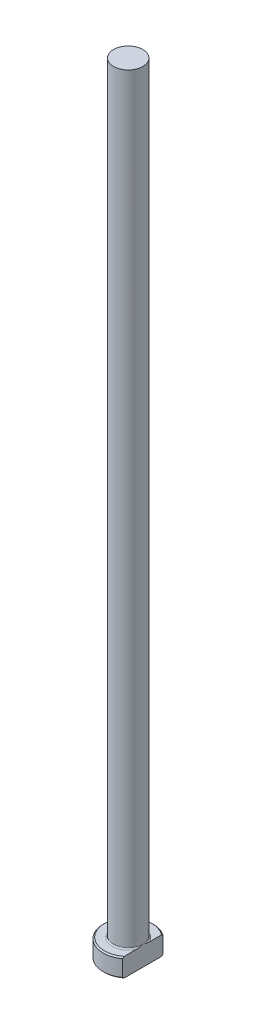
from build123d import *
from build123d.topology import SkipClean

# Parameters (mm, degrees)
CHAMFER1_SIZE = 0.2
FILLET1_R     = 0.2
KEY_DEPTH     = 126.127934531


with BuildPart() as part:
    # Sketch1 → Revolve1 (revolve)
    with BuildSketch(Plane.XY, mode=Mode.PRIVATE) as revolve1_sk:
        Polygon((0, 0), (-4, 0), (-4, 3), (-2.35, 3), (-2.35, 125), (0, 125), align=None)
    revolve(revolve1_sk.sketch.rotate(Axis((0, 259.958771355, 0), (0, -1, 0)), 270), axis=Axis((0, 259.958771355, 0), (0, -1, 0)))

    # Chamfer1
    chamfer1_edges = [part.edges().sort_by_distance(p)[0] for p in [
        (0, 3, -4),
        (0, 0, -4),
    ]]
    chamfer(chamfer1_edges, length=CHAMFER1_SIZE)

    # Fillet1
    fillet1_edges = [part.edges().sort_by_distance(p)[0] for p in [
        (0, 3, -2.35),
    ]]
    fillet(fillet1_edges, radius=FILLET1_R)

    # Sketch2 → KEY (cut, through all)
    with SkipClean():  # the faces are left unmerged after this step: merging them gives an invalid solid
        with BuildSketch(Plane(origin=(0, 0, 0), x_dir=(1, 0, 0), z_dir=(0, 1, 0))):
            with BuildLine():
                Line((2.35, 3.236896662), (2.35, -3.236896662))
                ThreePointArc((2.35, -3.236896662), (4, 0), (2.35, 3.236896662))
            make_face()
        extrude(amount=KEY_DEPTH, mode=Mode.SUBTRACT)


solid = part.part
